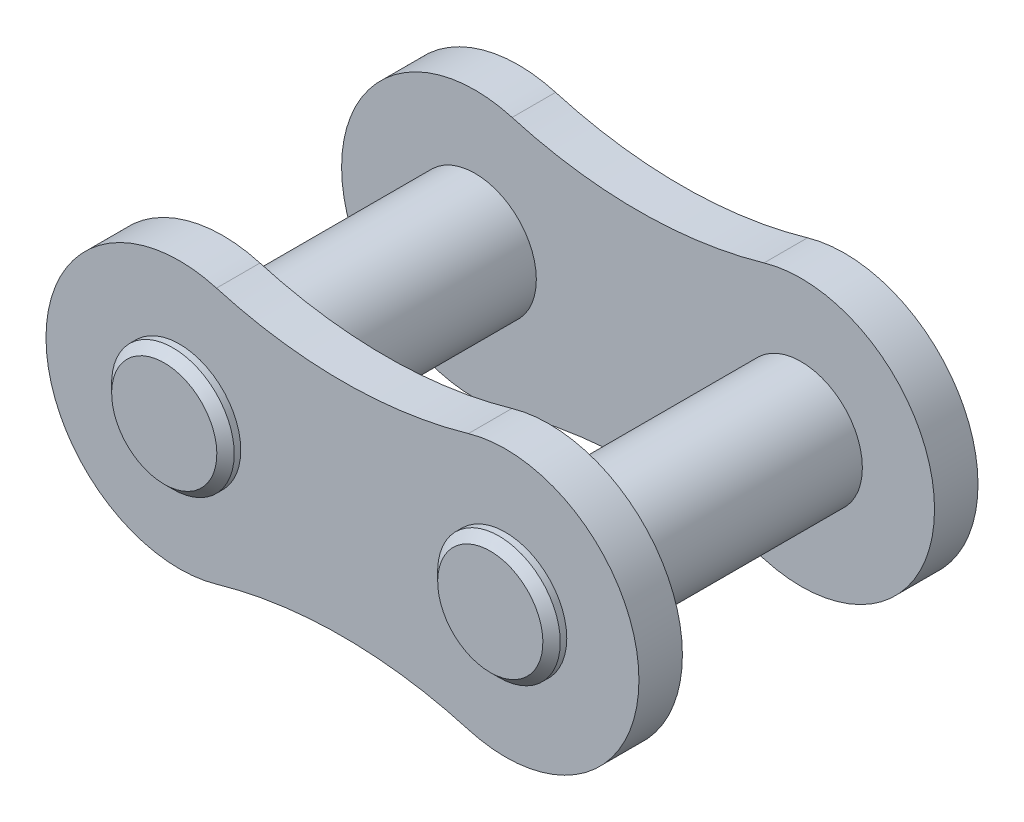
ISO-10303-21;
HEADER;
FILE_DESCRIPTION(('STEP AP214'),'2;1');
FILE_NAME('part.step','',(''),(''),'','','');
FILE_SCHEMA(('AUTOMOTIVE_DESIGN { 1 0 10303 214 1 1 1 1 }'));
ENDSEC;
DATA;
#1=APPLICATION_CONTEXT('core data for automotive mechanical design processes');
#2=APPLICATION_PROTOCOL_DEFINITION('international standard','automotive_design',2000,#1);
#3=PRODUCT_CONTEXT('',#1,'mechanical');
#4=PRODUCT('Part','Part','',(#3));
#5=PRODUCT_RELATED_PRODUCT_CATEGORY('part','',(#4));
#6=PRODUCT_DEFINITION_FORMATION('','',#4);
#7=PRODUCT_DEFINITION_CONTEXT('part definition',#1,'design');
#8=PRODUCT_DEFINITION('design','',#6,#7);
#9=PRODUCT_DEFINITION_SHAPE('','',#8);
#10=(LENGTH_UNIT() NAMED_UNIT(*) SI_UNIT(.MILLI.,.METRE.));
#11=(NAMED_UNIT(*) PLANE_ANGLE_UNIT() SI_UNIT($,.RADIAN.));
#12=(NAMED_UNIT(*) SI_UNIT($,.STERADIAN.) SOLID_ANGLE_UNIT());
#13=UNCERTAINTY_MEASURE_WITH_UNIT(LENGTH_MEASURE(1.E-05),#10,'distance_accuracy_value','');
#14=(GEOMETRIC_REPRESENTATION_CONTEXT(3) GLOBAL_UNCERTAINTY_ASSIGNED_CONTEXT((#13)) GLOBAL_UNIT_ASSIGNED_CONTEXT((#10,
#11,#12)) REPRESENTATION_CONTEXT('',''));
#15=CARTESIAN_POINT('',(0.,0.,0.));
#16=DIRECTION('',(0.,0.,1.));
#17=DIRECTION('',(1.,0.,0.));
#18=AXIS2_PLACEMENT_3D('',#15,#16,#17);
#19=CARTESIAN_POINT('',(0.,16.4795522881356,4.953));
#20=DIRECTION('',(0.,0.,-1.));
#21=DIRECTION('',(-1.,0.,0.));
#22=AXIS2_PLACEMENT_3D('',#19,#20,#21);
#23=CYLINDRICAL_SURFACE('',#22,13.2550222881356);
#24=CARTESIAN_POINT('',(0.,16.4795522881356,3.683));
#25=DIRECTION('',(0.,0.,1.));
#26=DIRECTION('',(1.,0.,0.));
#27=AXIS2_PLACEMENT_3D('',#24,#25,#26);
#28=CIRCLE('',#27,13.2550222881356);
#29=CARTESIAN_POINT('',(-3.68003553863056,3.74562303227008,3.683));
#30=VERTEX_POINT('',#29);
#31=CARTESIAN_POINT('',(3.68003553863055,3.74562303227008,3.683));
#32=VERTEX_POINT('',#31);
#33=EDGE_CURVE('E160',#30,#32,#28,.T.);
#34=ORIENTED_EDGE('',*,*,#33,.F.);
#35=DIRECTION('',(0.,0.,-1.));
#36=VECTOR('',#35,1.);
#37=CARTESIAN_POINT('',(-3.68003553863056,3.74562303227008,4.953));
#38=LINE('',#37,#36);
#39=CARTESIAN_POINT('',(-3.68003553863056,3.74562303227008,4.953));
#40=VERTEX_POINT('',#39);
#41=EDGE_CURVE('E11',#40,#30,#38,.T.);
#42=ORIENTED_EDGE('',*,*,#41,.F.);
#43=CARTESIAN_POINT('',(0.,16.4795522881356,4.953));
#44=DIRECTION('',(0.,0.,1.));
#45=DIRECTION('',(1.,0.,0.));
#46=AXIS2_PLACEMENT_3D('',#43,#44,#45);
#47=CIRCLE('',#46,13.2550222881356);
#48=CARTESIAN_POINT('',(3.68003553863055,3.74562303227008,4.953));
#49=VERTEX_POINT('',#48);
#50=EDGE_CURVE('E168',#40,#49,#47,.T.);
#51=ORIENTED_EDGE('',*,*,#50,.T.);
#52=DIRECTION('',(0.,0.,-1.));
#53=VECTOR('',#52,1.);
#54=CARTESIAN_POINT('',(3.68003553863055,3.74562303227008,4.953));
#55=LINE('',#54,#53);
#56=EDGE_CURVE('E75',#49,#32,#55,.T.);
#57=ORIENTED_EDGE('',*,*,#56,.T.);
#58=EDGE_LOOP('',(#34,#42,#51,#57));
#59=FACE_BOUND('',#58,.T.);
#60=ADVANCED_FACE('F36',(#59),#23,.F.);
#61=CARTESIAN_POINT('',(-4.76250000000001,0.,4.953));
#62=DIRECTION('',(0.,0.,-1.));
#63=DIRECTION('',(-1.,0.,0.));
#64=AXIS2_PLACEMENT_3D('',#61,#62,#63);
#65=CYLINDRICAL_SURFACE('',#64,3.8989);
#66=CARTESIAN_POINT('',(-4.76250000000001,0.,3.683));
#67=DIRECTION('',(0.,0.,1.));
#68=DIRECTION('',(1.,0.,0.));
#69=AXIS2_PLACEMENT_3D('',#66,#67,#68);
#70=CIRCLE('',#69,3.8989);
#71=CARTESIAN_POINT('',(-3.68003553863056,-3.74562303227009,3.683));
#72=VERTEX_POINT('',#71);
#73=EDGE_CURVE('E178',#30,#72,#70,.T.);
#74=ORIENTED_EDGE('',*,*,#73,.T.);
#75=DIRECTION('',(0.,0.,-1.));
#76=VECTOR('',#75,1.);
#77=CARTESIAN_POINT('',(-3.68003553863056,-3.74562303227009,4.953));
#78=LINE('',#77,#76);
#79=CARTESIAN_POINT('',(-3.68003553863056,-3.74562303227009,4.953));
#80=VERTEX_POINT('',#79);
#81=EDGE_CURVE('E44',#80,#72,#78,.T.);
#82=ORIENTED_EDGE('',*,*,#81,.F.);
#83=CARTESIAN_POINT('',(-4.76250000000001,0.,4.953));
#84=DIRECTION('',(0.,0.,1.));
#85=DIRECTION('',(1.,0.,0.));
#86=AXIS2_PLACEMENT_3D('',#83,#84,#85);
#87=CIRCLE('',#86,3.8989);
#88=EDGE_CURVE('E170',#40,#80,#87,.T.);
#89=ORIENTED_EDGE('',*,*,#88,.F.);
#90=ORIENTED_EDGE('',*,*,#41,.T.);
#91=EDGE_LOOP('',(#74,#82,#89,#90));
#92=FACE_BOUND('',#91,.T.);
#93=ADVANCED_FACE('F192',(#92),#65,.T.);
#94=CARTESIAN_POINT('',(0.,-16.4795522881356,4.953));
#95=DIRECTION('',(0.,0.,-1.));
#96=DIRECTION('',(-1.,0.,0.));
#97=AXIS2_PLACEMENT_3D('',#94,#95,#96);
#98=CYLINDRICAL_SURFACE('',#97,13.2550222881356);
#99=CARTESIAN_POINT('',(0.,-16.4795522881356,3.683));
#100=DIRECTION('',(0.,0.,1.));
#101=DIRECTION('',(1.,0.,0.));
#102=AXIS2_PLACEMENT_3D('',#99,#100,#101);
#103=CIRCLE('',#102,13.2550222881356);
#104=CARTESIAN_POINT('',(3.68003553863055,-3.74562303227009,3.683));
#105=VERTEX_POINT('',#104);
#106=EDGE_CURVE('E181',#105,#72,#103,.T.);
#107=ORIENTED_EDGE('',*,*,#106,.F.);
#108=DIRECTION('',(0.,0.,-1.));
#109=VECTOR('',#108,1.);
#110=CARTESIAN_POINT('',(3.68003553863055,-3.74562303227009,4.953));
#111=LINE('',#110,#109);
#112=CARTESIAN_POINT('',(3.68003553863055,-3.74562303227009,4.953));
#113=VERTEX_POINT('',#112);
#114=EDGE_CURVE('E68',#113,#105,#111,.T.);
#115=ORIENTED_EDGE('',*,*,#114,.F.);
#116=CARTESIAN_POINT('',(0.,-16.4795522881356,4.953));
#117=DIRECTION('',(0.,0.,1.));
#118=DIRECTION('',(1.,0.,0.));
#119=AXIS2_PLACEMENT_3D('',#116,#117,#118);
#120=CIRCLE('',#119,13.2550222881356);
#121=EDGE_CURVE('E172',#113,#80,#120,.T.);
#122=ORIENTED_EDGE('',*,*,#121,.T.);
#123=ORIENTED_EDGE('',*,*,#81,.T.);
#124=EDGE_LOOP('',(#107,#115,#122,#123));
#125=FACE_BOUND('',#124,.T.);
#126=ADVANCED_FACE('F189',(#125),#98,.F.);
#127=CARTESIAN_POINT('',(4.76249999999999,0.,4.953));
#128=DIRECTION('',(0.,0.,-1.));
#129=DIRECTION('',(-1.,0.,0.));
#130=AXIS2_PLACEMENT_3D('',#127,#128,#129);
#131=CYLINDRICAL_SURFACE('',#130,3.8989);
#132=CARTESIAN_POINT('',(4.76249999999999,0.,3.683));
#133=DIRECTION('',(0.,0.,1.));
#134=DIRECTION('',(1.,0.,0.));
#135=AXIS2_PLACEMENT_3D('',#132,#133,#134);
#136=CIRCLE('',#135,3.8989);
#137=EDGE_CURVE('E165',#105,#32,#136,.T.);
#138=ORIENTED_EDGE('',*,*,#137,.T.);
#139=ORIENTED_EDGE('',*,*,#56,.F.);
#140=CARTESIAN_POINT('',(4.76249999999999,0.,4.953));
#141=DIRECTION('',(0.,0.,1.));
#142=DIRECTION('',(1.,0.,0.));
#143=AXIS2_PLACEMENT_3D('',#140,#141,#142);
#144=CIRCLE('',#143,3.8989);
#145=EDGE_CURVE('E52',#113,#49,#144,.T.);
#146=ORIENTED_EDGE('',*,*,#145,.F.);
#147=ORIENTED_EDGE('',*,*,#114,.T.);
#148=EDGE_LOOP('',(#138,#139,#146,#147));
#149=FACE_BOUND('',#148,.T.);
#150=ADVANCED_FACE('F195',(#149),#131,.T.);
#151=CARTESIAN_POINT('',(4.76249999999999,0.,4.953));
#152=DIRECTION('',(0.,0.,1.));
#153=DIRECTION('',(1.,0.,0.));
#154=AXIS2_PLACEMENT_3D('',#151,#152,#153);
#155=PLANE('',#154);
#156=CARTESIAN_POINT('',(4.76249999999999,0.,4.953));
#157=DIRECTION('',(0.,0.,1.));
#158=DIRECTION('',(1.,0.,0.));
#159=AXIS2_PLACEMENT_3D('',#156,#157,#158);
#160=CIRCLE('',#159,1.79069999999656);
#161=CARTESIAN_POINT('',(6.55319999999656,0.,4.953));
#162=VERTEX_POINT('',#161);
#163=EDGE_CURVE('E161',#162,#162,#160,.T.);
#164=ORIENTED_EDGE('',*,*,#163,.F.);
#165=EDGE_LOOP('',(#164));
#166=FACE_BOUND('',#165,.T.);
#167=CARTESIAN_POINT('',(-4.76250000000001,0.,4.953));
#168=DIRECTION('',(0.,0.,1.));
#169=DIRECTION('',(1.,0.,0.));
#170=AXIS2_PLACEMENT_3D('',#167,#168,#169);
#171=CIRCLE('',#170,1.79070000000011);
#172=CARTESIAN_POINT('',(-2.9717999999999,0.,4.953));
#173=VERTEX_POINT('',#172);
#174=EDGE_CURVE('E164',#173,#173,#171,.T.);
#175=ORIENTED_EDGE('',*,*,#174,.F.);
#176=EDGE_LOOP('',(#175));
#177=FACE_BOUND('',#176,.T.);
#178=ORIENTED_EDGE('',*,*,#50,.F.);
#179=ORIENTED_EDGE('',*,*,#88,.T.);
#180=ORIENTED_EDGE('',*,*,#121,.F.);
#181=ORIENTED_EDGE('',*,*,#145,.T.);
#182=EDGE_LOOP('',(#178,#179,#180,#181));
#183=FACE_BOUND('',#182,.T.);
#184=ADVANCED_FACE('F196',(#166,#177,#183),#155,.T.);
#185=CARTESIAN_POINT('',(4.76249999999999,0.,3.683));
#186=DIRECTION('',(0.,0.,1.));
#187=DIRECTION('',(1.,0.,0.));
#188=AXIS2_PLACEMENT_3D('',#185,#186,#187);
#189=PLANE('',#188);
#190=CARTESIAN_POINT('',(4.76249999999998,0.,3.683));
#191=DIRECTION('',(0.,0.,1.));
#192=DIRECTION('',(1.,0.,0.));
#193=AXIS2_PLACEMENT_3D('',#190,#191,#192);
#194=CIRCLE('',#193,1.79069999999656);
#195=CARTESIAN_POINT('',(6.55319999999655,0.,3.683));
#196=VERTEX_POINT('',#195);
#197=EDGE_CURVE('E157',#196,#196,#194,.F.);
#198=ORIENTED_EDGE('',*,*,#197,.F.);
#199=EDGE_LOOP('',(#198));
#200=FACE_BOUND('',#199,.T.);
#201=CARTESIAN_POINT('',(-4.76249999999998,0.,3.683));
#202=DIRECTION('',(0.,0.,1.));
#203=DIRECTION('',(1.,0.,0.));
#204=AXIS2_PLACEMENT_3D('',#201,#202,#203);
#205=CIRCLE('',#204,1.79069999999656);
#206=CARTESIAN_POINT('',(-2.97180000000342,0.,3.683));
#207=VERTEX_POINT('',#206);
#208=EDGE_CURVE('E116',#207,#207,#205,.F.);
#209=ORIENTED_EDGE('',*,*,#208,.F.);
#210=EDGE_LOOP('',(#209));
#211=FACE_BOUND('',#210,.T.);
#212=ORIENTED_EDGE('',*,*,#33,.T.);
#213=ORIENTED_EDGE('',*,*,#137,.F.);
#214=ORIENTED_EDGE('',*,*,#106,.T.);
#215=ORIENTED_EDGE('',*,*,#73,.F.);
#216=EDGE_LOOP('',(#212,#213,#214,#215));
#217=FACE_BOUND('',#216,.T.);
#218=ADVANCED_FACE('F194',(#200,#211,#217),#189,.F.);
#219=CARTESIAN_POINT('',(-4.76249999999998,0.,-5.3975));
#220=DIRECTION('',(0.,0.,1.));
#221=DIRECTION('',(-0.426156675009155,-0.904649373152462,0.));
#222=AXIS2_PLACEMENT_3D('',#219,#220,#221);
#223=CYLINDRICAL_SURFACE('',#222,1.79069999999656);
#224=CARTESIAN_POINT('',(-4.76249999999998,0.,-5.1435));
#225=DIRECTION('',(0.,0.,-1.));
#226=DIRECTION('',(0.426156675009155,0.904649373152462,0.));
#227=AXIS2_PLACEMENT_3D('',#224,#225,#226);
#228=CIRCLE('',#227,1.79069999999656);
#229=CARTESIAN_POINT('',(-3.99938124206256,1.61995563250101,-5.1435));
#230=VERTEX_POINT('',#229);
#231=EDGE_CURVE('E457',#230,#230,#228,.F.);
#232=ORIENTED_EDGE('',*,*,#231,.T.);
#233=EDGE_LOOP('',(#232));
#234=FACE_BOUND('',#233,.T.);
#235=CARTESIAN_POINT('',(-4.76249999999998,0.,-4.953));
#236=DIRECTION('',(0.,0.,1.));
#237=DIRECTION('',(1.,0.,0.));
#238=AXIS2_PLACEMENT_3D('',#235,#236,#237);
#239=CIRCLE('',#238,1.79069999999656);
#240=CARTESIAN_POINT('',(-2.97180000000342,0.,-4.953));
#241=VERTEX_POINT('',#240);
#242=EDGE_CURVE('E466',#241,#241,#239,.F.);
#243=ORIENTED_EDGE('',*,*,#242,.T.);
#244=EDGE_LOOP('',(#243));
#245=FACE_BOUND('',#244,.T.);
#246=ADVANCED_FACE('F204',(#234,#245),#223,.T.);
#247=CARTESIAN_POINT('',(-4.76249999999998,0.,-5.3975));
#248=DIRECTION('',(0.,0.,1.));
#249=DIRECTION('',(-0.426156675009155,-0.904649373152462,0.));
#250=AXIS2_PLACEMENT_3D('',#247,#248,#249);
#251=CONICAL_SURFACE('',#250,1.53669999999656,0.785398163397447);
#252=ORIENTED_EDGE('',*,*,#231,.F.);
#253=EDGE_LOOP('',(#252));
#254=FACE_BOUND('',#253,.T.);
#255=CARTESIAN_POINT('',(-4.76249999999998,0.,-5.3975));
#256=DIRECTION('',(0.,0.,-1.));
#257=DIRECTION('',(0.426156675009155,0.904649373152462,0.));
#258=AXIS2_PLACEMENT_3D('',#255,#256,#257);
#259=CIRCLE('',#258,1.53669999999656);
#260=CARTESIAN_POINT('',(-4.10762503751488,1.39017469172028,-5.3975));
#261=VERTEX_POINT('',#260);
#262=EDGE_CURVE('E459',#261,#261,#259,.T.);
#263=ORIENTED_EDGE('',*,*,#262,.F.);
#264=EDGE_LOOP('',(#263));
#265=FACE_BOUND('',#264,.T.);
#266=ADVANCED_FACE('F395',(#254,#265),#251,.T.);
#267=CARTESIAN_POINT('',(-4.76249999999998,0.,-5.3975));
#268=DIRECTION('',(0.,0.,-1.));
#269=DIRECTION('',(0.426156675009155,0.904649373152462,0.));
#270=AXIS2_PLACEMENT_3D('',#267,#268,#269);
#271=PLANE('',#270);
#272=ORIENTED_EDGE('',*,*,#262,.T.);
#273=EDGE_LOOP('',(#272));
#274=FACE_BOUND('',#273,.T.);
#275=ADVANCED_FACE('F354',(#274),#271,.T.);
#276=CARTESIAN_POINT('',(4.76249999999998,0.,5.3975));
#277=DIRECTION('',(0.,0.,-1.));
#278=DIRECTION('',(0.426156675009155,-0.904649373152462,0.));
#279=AXIS2_PLACEMENT_3D('',#276,#277,#278);
#280=CYLINDRICAL_SURFACE('',#279,1.79069999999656);
#281=CARTESIAN_POINT('',(4.76249999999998,0.,-5.1435));
#282=DIRECTION('',(0.,0.,1.));
#283=DIRECTION('',(-0.426156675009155,0.904649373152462,0.));
#284=AXIS2_PLACEMENT_3D('',#281,#282,#283);
#285=CIRCLE('',#284,1.79069999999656);
#286=CARTESIAN_POINT('',(3.99938124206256,1.61995563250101,-5.1435));
#287=VERTEX_POINT('',#286);
#288=EDGE_CURVE('E472',#287,#287,#285,.T.);
#289=ORIENTED_EDGE('',*,*,#288,.T.);
#290=EDGE_LOOP('',(#289));
#291=FACE_BOUND('',#290,.T.);
#292=CARTESIAN_POINT('',(4.76249999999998,0.,-4.953));
#293=DIRECTION('',(0.,0.,1.));
#294=DIRECTION('',(1.,0.,0.));
#295=AXIS2_PLACEMENT_3D('',#292,#293,#294);
#296=CIRCLE('',#295,1.79069999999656);
#297=CARTESIAN_POINT('',(6.55319999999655,0.,-4.953));
#298=VERTEX_POINT('',#297);
#299=EDGE_CURVE('E143',#298,#298,#296,.F.);
#300=ORIENTED_EDGE('',*,*,#299,.T.);
#301=EDGE_LOOP('',(#300));
#302=FACE_BOUND('',#301,.T.);
#303=ADVANCED_FACE('F252',(#291,#302),#280,.T.);
#304=CARTESIAN_POINT('',(4.76249999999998,0.,-5.1435));
#305=DIRECTION('',(0.,0.,1.));
#306=DIRECTION('',(-0.426156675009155,0.904649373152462,0.));
#307=AXIS2_PLACEMENT_3D('',#304,#305,#306);
#308=CONICAL_SURFACE('',#307,1.79069999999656,0.785398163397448);
#309=CARTESIAN_POINT('',(4.76249999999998,0.,-5.3975));
#310=DIRECTION('',(0.,0.,1.));
#311=DIRECTION('',(-0.426156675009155,0.904649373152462,0.));
#312=AXIS2_PLACEMENT_3D('',#309,#310,#311);
#313=CIRCLE('',#312,1.53669999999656);
#314=CARTESIAN_POINT('',(4.10762503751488,1.39017469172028,-5.3975));
#315=VERTEX_POINT('',#314);
#316=EDGE_CURVE('E475',#315,#315,#313,.F.);
#317=ORIENTED_EDGE('',*,*,#316,.F.);
#318=EDGE_LOOP('',(#317));
#319=FACE_BOUND('',#318,.T.);
#320=ORIENTED_EDGE('',*,*,#288,.F.);
#321=EDGE_LOOP('',(#320));
#322=FACE_BOUND('',#321,.T.);
#323=ADVANCED_FACE('F333',(#319,#322),#308,.T.);
#324=CARTESIAN_POINT('',(4.76249999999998,0.,-5.3975));
#325=DIRECTION('',(0.,0.,1.));
#326=DIRECTION('',(-0.426156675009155,0.904649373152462,0.));
#327=AXIS2_PLACEMENT_3D('',#324,#325,#326);
#328=PLANE('',#327);
#329=ORIENTED_EDGE('',*,*,#316,.T.);
#330=EDGE_LOOP('',(#329));
#331=FACE_BOUND('',#330,.T.);
#332=ADVANCED_FACE('F322',(#331),#328,.F.);
#333=CARTESIAN_POINT('',(4.76249999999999,0.,-4.953));
#334=DIRECTION('',(0.,0.,1.));
#335=DIRECTION('',(1.,0.,0.));
#336=AXIS2_PLACEMENT_3D('',#333,#334,#335);
#337=PLANE('',#336);
#338=ORIENTED_EDGE('',*,*,#299,.F.);
#339=EDGE_LOOP('',(#338));
#340=FACE_BOUND('',#339,.T.);
#341=ORIENTED_EDGE('',*,*,#242,.F.);
#342=EDGE_LOOP('',(#341));
#343=FACE_BOUND('',#342,.T.);
#344=CARTESIAN_POINT('',(0.,16.4795522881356,-4.953));
#345=DIRECTION('',(0.,0.,1.));
#346=DIRECTION('',(1.,0.,0.));
#347=AXIS2_PLACEMENT_3D('',#344,#345,#346);
#348=CIRCLE('',#347,13.2550222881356);
#349=CARTESIAN_POINT('',(-3.68003553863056,3.74562303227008,-4.953));
#350=VERTEX_POINT('',#349);
#351=CARTESIAN_POINT('',(3.68003553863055,3.74562303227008,-4.953));
#352=VERTEX_POINT('',#351);
#353=EDGE_CURVE('E112',#350,#352,#348,.T.);
#354=ORIENTED_EDGE('',*,*,#353,.T.);
#355=CARTESIAN_POINT('',(4.76249999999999,0.,-4.953));
#356=DIRECTION('',(0.,0.,1.));
#357=DIRECTION('',(1.,0.,0.));
#358=AXIS2_PLACEMENT_3D('',#355,#356,#357);
#359=CIRCLE('',#358,3.8989);
#360=CARTESIAN_POINT('',(3.68003553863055,-3.74562303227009,-4.953));
#361=VERTEX_POINT('',#360);
#362=EDGE_CURVE('E148',#361,#352,#359,.T.);
#363=ORIENTED_EDGE('',*,*,#362,.F.);
#364=CARTESIAN_POINT('',(0.,-16.4795522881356,-4.953));
#365=DIRECTION('',(0.,0.,1.));
#366=DIRECTION('',(1.,0.,0.));
#367=AXIS2_PLACEMENT_3D('',#364,#365,#366);
#368=CIRCLE('',#367,13.2550222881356);
#369=CARTESIAN_POINT('',(-3.68003553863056,-3.74562303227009,-4.953));
#370=VERTEX_POINT('',#369);
#371=EDGE_CURVE('E145',#361,#370,#368,.T.);
#372=ORIENTED_EDGE('',*,*,#371,.T.);
#373=CARTESIAN_POINT('',(-4.76250000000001,0.,-4.953));
#374=DIRECTION('',(0.,0.,1.));
#375=DIRECTION('',(1.,0.,0.));
#376=AXIS2_PLACEMENT_3D('',#373,#374,#375);
#377=CIRCLE('',#376,3.8989);
#378=EDGE_CURVE('E142',#350,#370,#377,.T.);
#379=ORIENTED_EDGE('',*,*,#378,.F.);
#380=EDGE_LOOP('',(#354,#363,#372,#379));
#381=FACE_BOUND('',#380,.T.);
#382=ADVANCED_FACE('F311',(#340,#343,#381),#337,.F.);
#383=CARTESIAN_POINT('',(4.76249999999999,0.,-3.683));
#384=DIRECTION('',(0.,0.,1.));
#385=DIRECTION('',(1.,0.,0.));
#386=AXIS2_PLACEMENT_3D('',#383,#384,#385);
#387=PLANE('',#386);
#388=CARTESIAN_POINT('',(4.76249999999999,0.,-3.683));
#389=DIRECTION('',(0.,0.,1.));
#390=DIRECTION('',(1.,0.,0.));
#391=AXIS2_PLACEMENT_3D('',#388,#389,#390);
#392=CIRCLE('',#391,1.79069999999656);
#393=CARTESIAN_POINT('',(6.55319999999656,0.,-3.683));
#394=VERTEX_POINT('',#393);
#395=EDGE_CURVE('E134',#394,#394,#392,.T.);
#396=ORIENTED_EDGE('',*,*,#395,.F.);
#397=EDGE_LOOP('',(#396));
#398=FACE_BOUND('',#397,.T.);
#399=CARTESIAN_POINT('',(-4.76250000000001,0.,-3.683));
#400=DIRECTION('',(0.,0.,1.));
#401=DIRECTION('',(1.,0.,0.));
#402=AXIS2_PLACEMENT_3D('',#399,#400,#401);
#403=CIRCLE('',#402,1.79070000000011);
#404=CARTESIAN_POINT('',(-2.9717999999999,0.,-3.683));
#405=VERTEX_POINT('',#404);
#406=EDGE_CURVE('E131',#405,#405,#403,.T.);
#407=ORIENTED_EDGE('',*,*,#406,.F.);
#408=EDGE_LOOP('',(#407));
#409=FACE_BOUND('',#408,.T.);
#410=CARTESIAN_POINT('',(0.,16.4795522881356,-3.683));
#411=DIRECTION('',(0.,0.,1.));
#412=DIRECTION('',(1.,0.,0.));
#413=AXIS2_PLACEMENT_3D('',#410,#411,#412);
#414=CIRCLE('',#413,13.2550222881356);
#415=CARTESIAN_POINT('',(-3.68003553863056,3.74562303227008,-3.683));
#416=VERTEX_POINT('',#415);
#417=CARTESIAN_POINT('',(3.68003553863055,3.74562303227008,-3.683));
#418=VERTEX_POINT('',#417);
#419=EDGE_CURVE('E110',#416,#418,#414,.T.);
#420=ORIENTED_EDGE('',*,*,#419,.F.);
#421=CARTESIAN_POINT('',(-4.76250000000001,0.,-3.683));
#422=DIRECTION('',(0.,0.,1.));
#423=DIRECTION('',(1.,0.,0.));
#424=AXIS2_PLACEMENT_3D('',#421,#422,#423);
#425=CIRCLE('',#424,3.8989);
#426=CARTESIAN_POINT('',(-3.68003553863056,-3.74562303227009,-3.683));
#427=VERTEX_POINT('',#426);
#428=EDGE_CURVE('E120',#416,#427,#425,.T.);
#429=ORIENTED_EDGE('',*,*,#428,.T.);
#430=CARTESIAN_POINT('',(0.,-16.4795522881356,-3.683));
#431=DIRECTION('',(0.,0.,1.));
#432=DIRECTION('',(1.,0.,0.));
#433=AXIS2_PLACEMENT_3D('',#430,#431,#432);
#434=CIRCLE('',#433,13.2550222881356);
#435=CARTESIAN_POINT('',(3.68003553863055,-3.74562303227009,-3.683));
#436=VERTEX_POINT('',#435);
#437=EDGE_CURVE('E125',#436,#427,#434,.T.);
#438=ORIENTED_EDGE('',*,*,#437,.F.);
#439=CARTESIAN_POINT('',(4.76249999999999,0.,-3.683));
#440=DIRECTION('',(0.,0.,1.));
#441=DIRECTION('',(1.,0.,0.));
#442=AXIS2_PLACEMENT_3D('',#439,#440,#441);
#443=CIRCLE('',#442,3.8989);
#444=EDGE_CURVE('E129',#436,#418,#443,.T.);
#445=ORIENTED_EDGE('',*,*,#444,.T.);
#446=EDGE_LOOP('',(#420,#429,#438,#445));
#447=FACE_BOUND('',#446,.T.);
#448=ADVANCED_FACE('F127',(#398,#409,#447),#387,.T.);
#449=CARTESIAN_POINT('',(4.76249999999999,0.,-3.683));
#450=DIRECTION('',(0.,0.,-1.));
#451=DIRECTION('',(-1.,0.,0.));
#452=AXIS2_PLACEMENT_3D('',#449,#450,#451);
#453=CYLINDRICAL_SURFACE('',#452,3.8989);
#454=ORIENTED_EDGE('',*,*,#362,.T.);
#455=DIRECTION('',(0.,0.,-1.));
#456=VECTOR('',#455,1.);
#457=CARTESIAN_POINT('',(3.68003553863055,3.74562303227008,-3.683));
#458=LINE('',#457,#456);
#459=EDGE_CURVE('E140',#418,#352,#458,.T.);
#460=ORIENTED_EDGE('',*,*,#459,.F.);
#461=ORIENTED_EDGE('',*,*,#444,.F.);
#462=DIRECTION('',(0.,0.,-1.));
#463=VECTOR('',#462,1.);
#464=CARTESIAN_POINT('',(3.68003553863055,-3.74562303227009,-3.683));
#465=LINE('',#464,#463);
#466=EDGE_CURVE('E152',#436,#361,#465,.T.);
#467=ORIENTED_EDGE('',*,*,#466,.T.);
#468=EDGE_LOOP('',(#454,#460,#461,#467));
#469=FACE_BOUND('',#468,.T.);
#470=ADVANCED_FACE('F290',(#469),#453,.T.);
#471=CARTESIAN_POINT('',(0.,-16.4795522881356,-3.683));
#472=DIRECTION('',(0.,0.,-1.));
#473=DIRECTION('',(-1.,0.,0.));
#474=AXIS2_PLACEMENT_3D('',#471,#472,#473);
#475=CYLINDRICAL_SURFACE('',#474,13.2550222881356);
#476=ORIENTED_EDGE('',*,*,#371,.F.);
#477=ORIENTED_EDGE('',*,*,#466,.F.);
#478=ORIENTED_EDGE('',*,*,#437,.T.);
#479=DIRECTION('',(0.,0.,-1.));
#480=VECTOR('',#479,1.);
#481=CARTESIAN_POINT('',(-3.68003553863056,-3.74562303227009,-3.683));
#482=LINE('',#481,#480);
#483=EDGE_CURVE('E117',#427,#370,#482,.T.);
#484=ORIENTED_EDGE('',*,*,#483,.T.);
#485=EDGE_LOOP('',(#476,#477,#478,#484));
#486=FACE_BOUND('',#485,.T.);
#487=ADVANCED_FACE('F280',(#486),#475,.F.);
#488=CARTESIAN_POINT('',(-4.76250000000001,0.,-3.683));
#489=DIRECTION('',(0.,0.,-1.));
#490=DIRECTION('',(-1.,0.,0.));
#491=AXIS2_PLACEMENT_3D('',#488,#489,#490);
#492=CYLINDRICAL_SURFACE('',#491,3.8989);
#493=ORIENTED_EDGE('',*,*,#378,.T.);
#494=ORIENTED_EDGE('',*,*,#483,.F.);
#495=ORIENTED_EDGE('',*,*,#428,.F.);
#496=DIRECTION('',(0.,0.,-1.));
#497=VECTOR('',#496,1.);
#498=CARTESIAN_POINT('',(-3.68003553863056,3.74562303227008,-3.683));
#499=LINE('',#498,#497);
#500=EDGE_CURVE('E106',#416,#350,#499,.T.);
#501=ORIENTED_EDGE('',*,*,#500,.T.);
#502=EDGE_LOOP('',(#493,#494,#495,#501));
#503=FACE_BOUND('',#502,.T.);
#504=ADVANCED_FACE('F121',(#503),#492,.T.);
#505=CARTESIAN_POINT('',(0.,16.4795522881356,-3.683));
#506=DIRECTION('',(0.,0.,-1.));
#507=DIRECTION('',(-1.,0.,0.));
#508=AXIS2_PLACEMENT_3D('',#505,#506,#507);
#509=CYLINDRICAL_SURFACE('',#508,13.2550222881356);
#510=ORIENTED_EDGE('',*,*,#353,.F.);
#511=ORIENTED_EDGE('',*,*,#500,.F.);
#512=ORIENTED_EDGE('',*,*,#419,.T.);
#513=ORIENTED_EDGE('',*,*,#459,.T.);
#514=EDGE_LOOP('',(#510,#511,#512,#513));
#515=FACE_BOUND('',#514,.T.);
#516=ADVANCED_FACE('F108',(#515),#509,.F.);
#517=ORIENTED_EDGE('',*,*,#406,.T.);
#518=EDGE_LOOP('',(#517));
#519=FACE_BOUND('',#518,.T.);
#520=ORIENTED_EDGE('',*,*,#208,.T.);
#521=EDGE_LOOP('',(#520));
#522=FACE_BOUND('',#521,.T.);
#523=ADVANCED_FACE('F249',(#519,#522),#223,.T.);
#524=ORIENTED_EDGE('',*,*,#395,.T.);
#525=EDGE_LOOP('',(#524));
#526=FACE_BOUND('',#525,.T.);
#527=ORIENTED_EDGE('',*,*,#197,.T.);
#528=EDGE_LOOP('',(#527));
#529=FACE_BOUND('',#528,.T.);
#530=ADVANCED_FACE('F243',(#526,#529),#280,.T.);
#531=CARTESIAN_POINT('',(-4.76249999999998,0.,5.3975));
#532=DIRECTION('',(0.,0.,-1.));
#533=DIRECTION('',(0.426156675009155,0.904649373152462,0.));
#534=AXIS2_PLACEMENT_3D('',#531,#532,#533);
#535=PLANE('',#534);
#536=CARTESIAN_POINT('',(-4.76249999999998,0.,5.3975));
#537=DIRECTION('',(0.,0.,-1.));
#538=DIRECTION('',(0.426156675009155,0.904649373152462,0.));
#539=AXIS2_PLACEMENT_3D('',#536,#537,#538);
#540=CIRCLE('',#539,1.53669999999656);
#541=CARTESIAN_POINT('',(-4.10762503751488,1.39017469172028,5.3975));
#542=VERTEX_POINT('',#541);
#543=EDGE_CURVE('E452',#542,#542,#540,.F.);
#544=ORIENTED_EDGE('',*,*,#543,.T.);
#545=EDGE_LOOP('',(#544));
#546=FACE_BOUND('',#545,.T.);
#547=ADVANCED_FACE('F248',(#546),#535,.F.);
#548=CARTESIAN_POINT('',(-4.76249999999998,0.,5.1435));
#549=DIRECTION('',(0.,0.,-1.));
#550=DIRECTION('',(0.426156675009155,0.904649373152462,0.));
#551=AXIS2_PLACEMENT_3D('',#548,#549,#550);
#552=CONICAL_SURFACE('',#551,1.79069999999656,0.785398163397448);
#553=ORIENTED_EDGE('',*,*,#543,.F.);
#554=EDGE_LOOP('',(#553));
#555=FACE_BOUND('',#554,.T.);
#556=CARTESIAN_POINT('',(-4.76249999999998,0.,5.1435));
#557=DIRECTION('',(0.,0.,-1.));
#558=DIRECTION('',(0.426156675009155,0.904649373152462,0.));
#559=AXIS2_PLACEMENT_3D('',#556,#557,#558);
#560=CIRCLE('',#559,1.79069999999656);
#561=CARTESIAN_POINT('',(-3.99938124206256,1.61995563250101,5.1435));
#562=VERTEX_POINT('',#561);
#563=EDGE_CURVE('E455',#562,#562,#560,.T.);
#564=ORIENTED_EDGE('',*,*,#563,.F.);
#565=EDGE_LOOP('',(#564));
#566=FACE_BOUND('',#565,.T.);
#567=ADVANCED_FACE('F422',(#555,#566),#552,.T.);
#568=ORIENTED_EDGE('',*,*,#174,.T.);
#569=EDGE_LOOP('',(#568));
#570=FACE_BOUND('',#569,.T.);
#571=ORIENTED_EDGE('',*,*,#563,.T.);
#572=EDGE_LOOP('',(#571));
#573=FACE_BOUND('',#572,.T.);
#574=ADVANCED_FACE('F263',(#570,#573),#223,.T.);
#575=ORIENTED_EDGE('',*,*,#163,.T.);
#576=EDGE_LOOP('',(#575));
#577=FACE_BOUND('',#576,.T.);
#578=CARTESIAN_POINT('',(4.76249999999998,0.,5.1435));
#579=DIRECTION('',(0.,0.,1.));
#580=DIRECTION('',(-0.426156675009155,0.904649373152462,0.));
#581=AXIS2_PLACEMENT_3D('',#578,#579,#580);
#582=CIRCLE('',#581,1.79069999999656);
#583=CARTESIAN_POINT('',(3.99938124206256,1.61995563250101,5.1435));
#584=VERTEX_POINT('',#583);
#585=EDGE_CURVE('E469',#584,#584,#582,.F.);
#586=ORIENTED_EDGE('',*,*,#585,.T.);
#587=EDGE_LOOP('',(#586));
#588=FACE_BOUND('',#587,.T.);
#589=ADVANCED_FACE('F253',(#577,#588),#280,.T.);
#590=CARTESIAN_POINT('',(4.76249999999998,0.,5.3975));
#591=DIRECTION('',(0.,0.,1.));
#592=DIRECTION('',(-0.426156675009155,0.904649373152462,0.));
#593=AXIS2_PLACEMENT_3D('',#590,#591,#592);
#594=PLANE('',#593);
#595=CARTESIAN_POINT('',(4.76249999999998,0.,5.3975));
#596=DIRECTION('',(0.,0.,1.));
#597=DIRECTION('',(-0.426156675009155,0.904649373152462,0.));
#598=AXIS2_PLACEMENT_3D('',#595,#596,#597);
#599=CIRCLE('',#598,1.53669999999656);
#600=CARTESIAN_POINT('',(4.10762503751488,1.39017469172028,5.3975));
#601=VERTEX_POINT('',#600);
#602=EDGE_CURVE('E478',#601,#601,#599,.T.);
#603=ORIENTED_EDGE('',*,*,#602,.T.);
#604=EDGE_LOOP('',(#603));
#605=FACE_BOUND('',#604,.T.);
#606=ADVANCED_FACE('F363',(#605),#594,.T.);
#607=CARTESIAN_POINT('',(4.76249999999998,0.,5.3975));
#608=DIRECTION('',(0.,0.,-1.));
#609=DIRECTION('',(0.426156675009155,-0.904649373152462,0.));
#610=AXIS2_PLACEMENT_3D('',#607,#608,#609);
#611=CONICAL_SURFACE('',#610,1.53669999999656,0.785398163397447);
#612=ORIENTED_EDGE('',*,*,#585,.F.);
#613=EDGE_LOOP('',(#612));
#614=FACE_BOUND('',#613,.T.);
#615=ORIENTED_EDGE('',*,*,#602,.F.);
#616=EDGE_LOOP('',(#615));
#617=FACE_BOUND('',#616,.T.);
#618=ADVANCED_FACE('F374',(#614,#617),#611,.T.);
#619=CLOSED_SHELL('',(#60,#93,#126,#150,#184,#218,#246,#266,#275,#303,#323,#332,#382,#448,#470,
#487,#504,#516,#523,#530,#547,#567,#574,#589,#606,#618));
#620=MANIFOLD_SOLID_BREP('B2',#619);
#621=ADVANCED_BREP_SHAPE_REPRESENTATION('',(#18,#620),#14);
#622=SHAPE_DEFINITION_REPRESENTATION(#9,#621);
ENDSEC;
END-ISO-10303-21;
